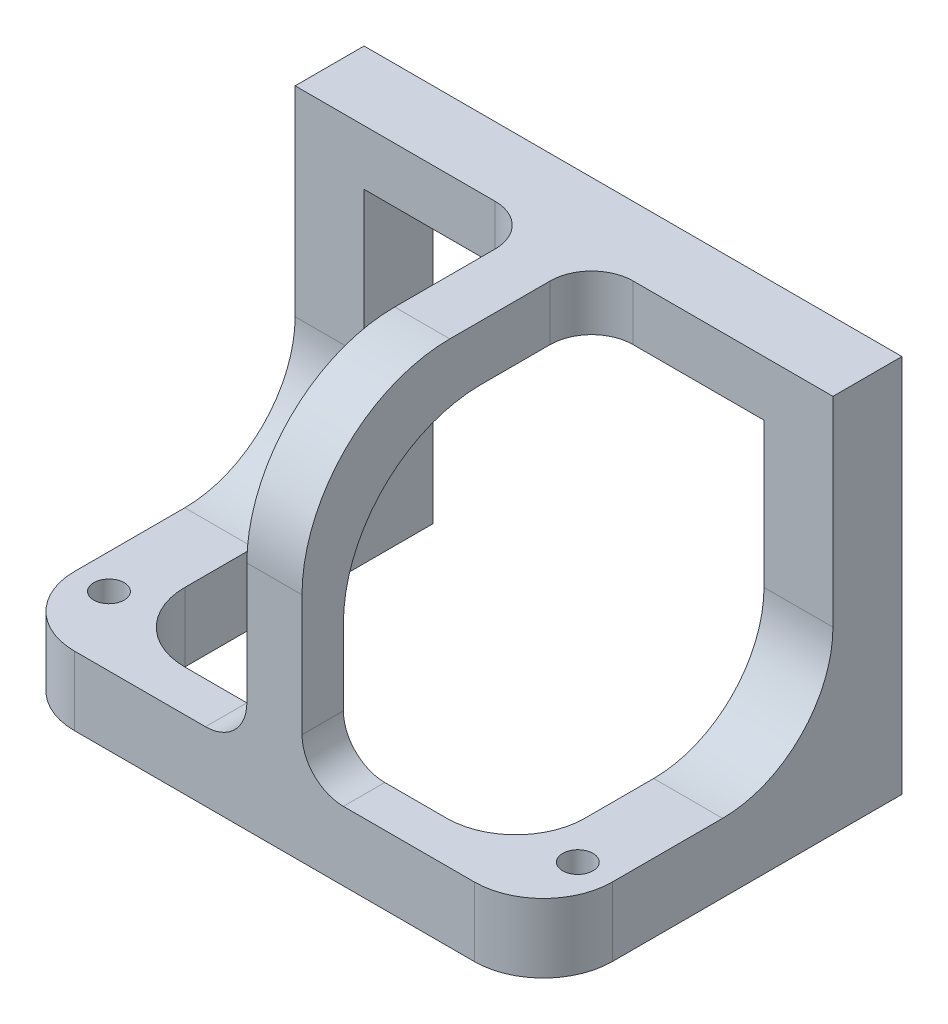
from build123d import *

# Parameters (mm, degrees)
EXTRUDE_1_DEPTH     = 5
SKETCH_2_R          = 1.35
CUT_EXTRUDE_1_DEPTH = 36.035696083
EXTRUDE_2_DEPTH     = 2
SKETCH_4_W          = 5
SKETCH_4_H          = 5
EXTRUDE_3_DEPTH     = 21
SKETCH_5_W          = 3
SKETCH_5_H          = 5
EXTRUDE_4_DEPTH     = 16.5
SKETCH_8_W          = 6
SKETCH_8_H          = 4
CUT_EXTRUDE_3_DEPTH = 43.982554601
SKETCH_9_R          = 1
SKETCH_9_R_2        = 1.1
CUT_EXTRUDE_4_DEPTH = 40.528470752
FILLET_2_R          = 5
CUT_EXTRUDE_START   = -6
SKETCH_10_R         = 1
CUT_EXTRUDE_5_DEPTH = 6
FILLET_3_R          = 8
FILLET_4_R          = 3


with BuildPart() as part:
    # Sketch 1 → Extrude 1 (new body)
    with BuildSketch(Plane.XY):
        Polygon((-14.5, 23.5), (14.5, 23.5), (14.5, 0), (25.5, 0), (25.5, 4), (19.5, 4), (19.5, 27.5), (-19.5, 27.5), (-19.5, 4), (-25.5, 4), (-25.5, 0), (-14.5, 0), align=None)
    extrude(amount=EXTRUDE_1_DEPTH)

    # Sketch 2 → Cut-Extrude 1 (cut, through all)
    with BuildSketch(Plane(origin=(0, 4, 0), x_dir=(1, 0, 0), z_dir=(0, 1, 0))):
        with Locations(Location((22.5, -2.5, 0), (0, 0, 180))):
            Circle(SKETCH_2_R)
        with Locations((-22.5, -2.5)):
            Circle(SKETCH_2_R)
    extrude(amount=-CUT_EXTRUDE_1_DEPTH, mode=Mode.SUBTRACT)

    # Sketch 3 → Extrude 2 (add, symmetric)
    with BuildSketch(Plane(origin=(0, 0, 0), x_dir=(0, 0, -1), z_dir=(1, 0, 0))):
        with BuildLine():
            Line((-5, 23.5), (-13, 23.5))
            ThreePointArc((-13, 23.5), (-20.071067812, 20.571067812), (-23, 13.5))
            Line((-23, 13.5), (-23, 0))
            Line((-23, 0), (-26, 0))
            Line((-26, 0), (-26, 16.783882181))
            ThreePointArc((-26, 16.783882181), (-22.861321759, 24.361321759), (-15.283882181, 27.5))
            Line((-15.283882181, 27.5), (-5, 27.5))
            Line((-5, 27.5), (-5, 23.5))
        make_face()
    extrude(amount=EXTRUDE_2_DEPTH, both=True)

    # Sketch 4 → Extrude 3 (add)
    with BuildSketch(Plane.XY.offset(5)):
        with Locations((17, 2.5)):
            Rectangle(SKETCH_4_W, SKETCH_4_H)
    extrude_3 = extrude(amount=EXTRUDE_3_DEPTH)

    # Sketch 5 → Extrude 4 (add)
    with BuildSketch(Plane.ZY.offset(-14.5)):
        with Locations((24.5, 2.5)):
            Rectangle(SKETCH_5_W, SKETCH_5_H)
    extrude_4 = extrude(amount=EXTRUDE_4_DEPTH)

    # Mirror 1: Extrude 3, Extrude 4 across plane
    add(extrude_3.mirror(Plane(origin=(0, 0, 0), x_dir=(0, 0, 1), z_dir=(1, 0, 0))))
    add(extrude_4.mirror(Plane(origin=(0, 0, 0), x_dir=(0, 0, 1), z_dir=(1, 0, 0))))

    # Sketch 8 → Cut-Extrude 3 (cut, through all)
    with BuildSketch(Plane.XY.offset(5)):
        with Locations((-22.5, 2)):
            Rectangle(SKETCH_8_W, SKETCH_8_H)
        with Locations((22.5, 2)):
            Rectangle(SKETCH_8_W, SKETCH_8_H)
    extrude(amount=-CUT_EXTRUDE_3_DEPTH, mode=Mode.SUBTRACT)

    # Sketch 9 → Cut-Extrude 4 (cut, through all)
    with BuildSketch(Plane(origin=(0, 5, 0), x_dir=(1, 0, 0), z_dir=(0, 1, 0))):
        with Locations(Location((-17, -2.5, 0), (0, 0, 270))):
            Circle(SKETCH_9_R)
        with Locations(Location((17, -2.5, 0), (0, 0, 90))):
            Circle(SKETCH_9_R)
        with Locations(Location((-17, -21, 0), (0, 0, 270))):
            Circle(SKETCH_9_R_2)
        with Locations(Location((17, -21, 0), (0, 0, 90))):
            Circle(SKETCH_9_R_2)
    extrude(amount=-CUT_EXTRUDE_4_DEPTH, mode=Mode.SUBTRACT)

    # Fillet 2
    fillet_2_edges = [part.edges().sort_by_distance(p)[0] for p in [
        (-14.5, 2.5, 23),
        (19.5, 2.5, 26),
        (14.5, 2.5, 23),
        (-19.5, 2.5, 26),
    ]]
    fillet(fillet_2_edges, radius=FILLET_2_R)

    # Sketch 10 → Cut-Extrude 5 (cut)
    with BuildSketch(Plane.XZ.offset(-5).offset(CUT_EXTRUDE_START)):
        with Locations(Location((-17, 2.5, 0), (0, 0, 90))):
            Circle(SKETCH_10_R)
        with Locations(Location((17, 2.5, 0), (0, 0, 270))):
            Circle(SKETCH_10_R)
    extrude(amount=CUT_EXTRUDE_5_DEPTH, mode=Mode.SUBTRACT)

    # Fillet 3
    fillet_3_edges = [part.edges().sort_by_distance(p)[0] for p in [
        (17, 5, 5),
        (-17, 5, 5),
    ]]
    fillet(fillet_3_edges, radius=FILLET_3_R)

    # Fillet 4
    fillet_4_edges = [part.edges().sort_by_distance(p)[0] for p in [
        (-2, 25.5, 5),
        (2, 25.5, 5),
        (2, 5, 24.5),
        (-2, 5, 24.5),
    ]]
    fillet(fillet_4_edges, radius=FILLET_4_R)


solid = part.part
